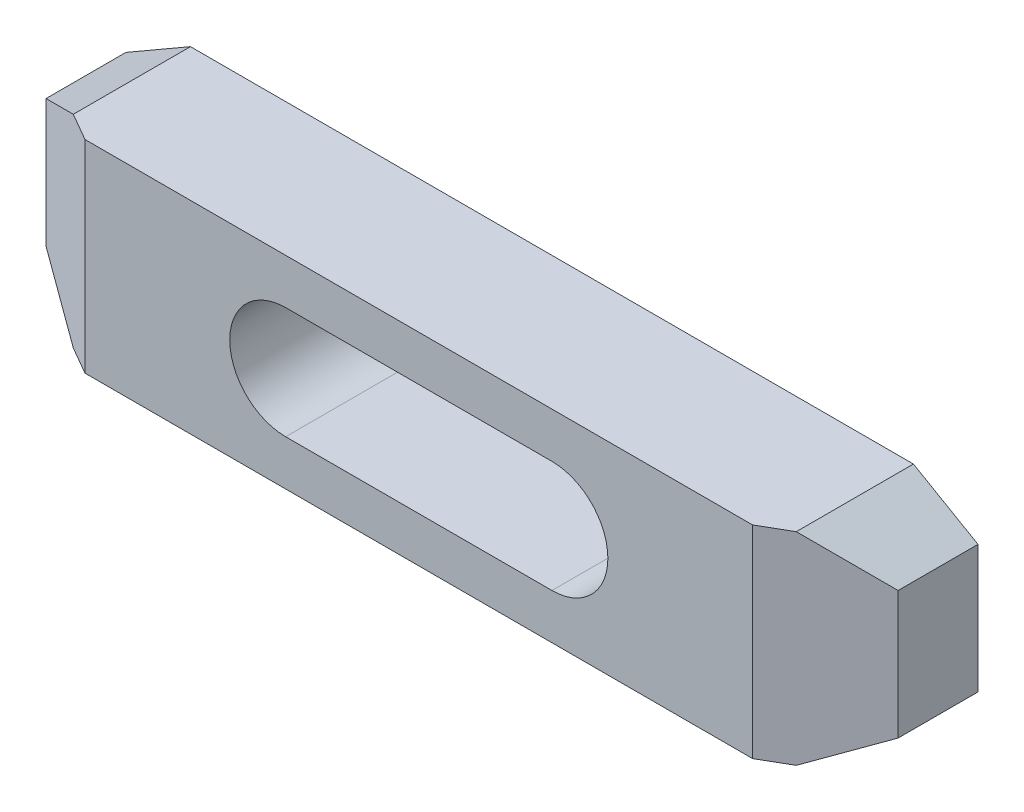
ISO-10303-21;
HEADER;
FILE_DESCRIPTION(('STEP AP214'),'2;1');
FILE_NAME('part.step','',(''),(''),'','','');
FILE_SCHEMA(('AUTOMOTIVE_DESIGN { 1 0 10303 214 1 1 1 1 }'));
ENDSEC;
DATA;
#1=APPLICATION_CONTEXT('core data for automotive mechanical design processes');
#2=APPLICATION_PROTOCOL_DEFINITION('international standard','automotive_design',2000,#1);
#3=PRODUCT_CONTEXT('',#1,'mechanical');
#4=PRODUCT('Part','Part','',(#3));
#5=PRODUCT_RELATED_PRODUCT_CATEGORY('part','',(#4));
#6=PRODUCT_DEFINITION_FORMATION('','',#4);
#7=PRODUCT_DEFINITION_CONTEXT('part definition',#1,'design');
#8=PRODUCT_DEFINITION('design','',#6,#7);
#9=PRODUCT_DEFINITION_SHAPE('','',#8);
#10=(LENGTH_UNIT() NAMED_UNIT(*) SI_UNIT(.MILLI.,.METRE.));
#11=(NAMED_UNIT(*) PLANE_ANGLE_UNIT() SI_UNIT($,.RADIAN.));
#12=(NAMED_UNIT(*) SI_UNIT($,.STERADIAN.) SOLID_ANGLE_UNIT());
#13=UNCERTAINTY_MEASURE_WITH_UNIT(LENGTH_MEASURE(1.E-05),#10,'distance_accuracy_value','');
#14=(GEOMETRIC_REPRESENTATION_CONTEXT(3) GLOBAL_UNCERTAINTY_ASSIGNED_CONTEXT((#13)) GLOBAL_UNIT_ASSIGNED_CONTEXT((#10,
#11,#12)) REPRESENTATION_CONTEXT('',''));
#15=CARTESIAN_POINT('',(0.,0.,0.));
#16=DIRECTION('',(0.,0.,1.));
#17=DIRECTION('',(1.,0.,0.));
#18=AXIS2_PLACEMENT_3D('',#15,#16,#17);
#19=CARTESIAN_POINT('',(0.,-58.1880215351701,25.));
#20=DIRECTION('',(0.,0.,-1.));
#21=DIRECTION('',(-1.,0.,0.));
#22=AXIS2_PLACEMENT_3D('',#19,#20,#21);
#23=PLANE('',#22);
#24=CARTESIAN_POINT('',(25.,0.,25.));
#25=DIRECTION('',(0.,0.,1.));
#26=DIRECTION('',(1.,0.,0.));
#27=AXIS2_PLACEMENT_3D('',#24,#25,#26);
#28=CIRCLE('',#27,10.5);
#29=CARTESIAN_POINT('',(25.,-10.5,25.));
#30=VERTEX_POINT('',#29);
#31=CARTESIAN_POINT('',(25.,10.5,25.));
#32=VERTEX_POINT('',#31);
#33=EDGE_CURVE('E200',#30,#32,#28,.T.);
#34=ORIENTED_EDGE('',*,*,#33,.F.);
#35=DIRECTION('',(-1.,0.,0.));
#36=VECTOR('',#35,1.);
#37=CARTESIAN_POINT('',(25.,-10.5,25.));
#38=LINE('',#37,#36);
#39=CARTESIAN_POINT('',(-25.,-10.5,25.));
#40=VERTEX_POINT('',#39);
#41=EDGE_CURVE('E199',#30,#40,#38,.T.);
#42=ORIENTED_EDGE('',*,*,#41,.T.);
#43=CARTESIAN_POINT('',(-25.,0.,25.));
#44=DIRECTION('',(0.,0.,1.));
#45=DIRECTION('',(1.,0.,0.));
#46=AXIS2_PLACEMENT_3D('',#43,#44,#45);
#47=CIRCLE('',#46,10.5);
#48=CARTESIAN_POINT('',(-25.,10.5,25.));
#49=VERTEX_POINT('',#48);
#50=EDGE_CURVE('E207',#49,#40,#47,.T.);
#51=ORIENTED_EDGE('',*,*,#50,.F.);
#52=DIRECTION('',(-1.,0.,0.));
#53=VECTOR('',#52,1.);
#54=CARTESIAN_POINT('',(25.,10.5,25.));
#55=LINE('',#54,#53);
#56=EDGE_CURVE('E203',#32,#49,#55,.T.);
#57=ORIENTED_EDGE('',*,*,#56,.F.);
#58=EDGE_LOOP('',(#34,#42,#51,#57));
#59=FACE_BOUND('',#58,.T.);
#60=DIRECTION('',(0.,1.,0.));
#61=VECTOR('',#60,1.);
#62=CARTESIAN_POINT('',(-62.679491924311,-58.1880215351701,25.));
#63=LINE('',#62,#61);
#64=CARTESIAN_POINT('',(-62.679491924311,-19.,25.));
#65=VERTEX_POINT('',#64);
#66=CARTESIAN_POINT('',(-62.679491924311,19.,25.));
#67=VERTEX_POINT('',#66);
#68=EDGE_CURVE('E128',#65,#67,#63,.T.);
#69=ORIENTED_EDGE('',*,*,#68,.F.);
#70=DIRECTION('',(-1.,0.,0.));
#71=VECTOR('',#70,1.);
#72=CARTESIAN_POINT('',(67.8756443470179,-19.,25.));
#73=LINE('',#72,#71);
#74=CARTESIAN_POINT('',(62.6794919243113,-19.,25.));
#75=VERTEX_POINT('',#74);
#76=EDGE_CURVE('E168',#75,#65,#73,.T.);
#77=ORIENTED_EDGE('',*,*,#76,.F.);
#78=DIRECTION('',(0.,1.,0.));
#79=VECTOR('',#78,1.);
#80=CARTESIAN_POINT('',(62.6794919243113,-58.1880215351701,25.));
#81=LINE('',#80,#79);
#82=CARTESIAN_POINT('',(62.6794919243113,19.,25.));
#83=VERTEX_POINT('',#82);
#84=EDGE_CURVE('E36',#75,#83,#81,.T.);
#85=ORIENTED_EDGE('',*,*,#84,.T.);
#86=DIRECTION('',(1.,0.,0.));
#87=VECTOR('',#86,1.);
#88=CARTESIAN_POINT('',(-67.8756443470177,19.,25.));
#89=LINE('',#88,#87);
#90=EDGE_CURVE('E167',#67,#83,#89,.T.);
#91=ORIENTED_EDGE('',*,*,#90,.F.);
#92=EDGE_LOOP('',(#69,#77,#85,#91));
#93=FACE_BOUND('',#92,.T.);
#94=ADVANCED_FACE('F14',(#59,#93),#23,.F.);
#95=CARTESIAN_POINT('',(-67.8756443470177,19.,25.));
#96=DIRECTION('',(0.,1.,0.));
#97=DIRECTION('',(-1.,0.,0.));
#98=AXIS2_PLACEMENT_3D('',#95,#96,#97);
#99=PLANE('',#98);
#100=DIRECTION('',(0.,0.,-1.));
#101=VECTOR('',#100,1.);
#102=CARTESIAN_POINT('',(-67.8756443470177,19.,25.));
#103=LINE('',#102,#101);
#104=CARTESIAN_POINT('',(-67.8756443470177,19.,22.));
#105=VERTEX_POINT('',#104);
#106=CARTESIAN_POINT('',(-67.8756443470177,19.,0.));
#107=VERTEX_POINT('',#106);
#108=EDGE_CURVE('E136',#105,#107,#103,.T.);
#109=ORIENTED_EDGE('',*,*,#108,.F.);
#110=DIRECTION('',(0.866025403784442,0.,0.5));
#111=VECTOR('',#110,1.);
#112=CARTESIAN_POINT('',(-66.576606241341,19.,22.75));
#113=LINE('',#112,#111);
#114=EDGE_CURVE('E229',#105,#67,#113,.T.);
#115=ORIENTED_EDGE('',*,*,#114,.T.);
#116=ORIENTED_EDGE('',*,*,#90,.T.);
#117=DIRECTION('',(-0.866025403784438,0.,0.5));
#118=VECTOR('',#117,1.);
#119=CARTESIAN_POINT('',(-35.2368602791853,19.,81.5320323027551));
#120=LINE('',#119,#118);
#121=CARTESIAN_POINT('',(67.8756443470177,19.,22.));
#122=VERTEX_POINT('',#121);
#123=EDGE_CURVE('E224',#122,#83,#120,.T.);
#124=ORIENTED_EDGE('',*,*,#123,.F.);
#125=DIRECTION('',(0.,0.,-1.));
#126=VECTOR('',#125,1.);
#127=CARTESIAN_POINT('',(67.8756443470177,19.,25.));
#128=LINE('',#127,#126);
#129=CARTESIAN_POINT('',(67.8756443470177,19.,0.));
#130=VERTEX_POINT('',#129);
#131=EDGE_CURVE('E143',#122,#130,#128,.T.);
#132=ORIENTED_EDGE('',*,*,#131,.T.);
#133=DIRECTION('',(1.,0.,0.));
#134=VECTOR('',#133,1.);
#135=CARTESIAN_POINT('',(-67.8756443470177,19.,0.));
#136=LINE('',#135,#134);
#137=EDGE_CURVE('E183',#107,#130,#136,.T.);
#138=ORIENTED_EDGE('',*,*,#137,.F.);
#139=EDGE_LOOP('',(#109,#115,#116,#124,#132,#138));
#140=FACE_BOUND('',#139,.T.);
#141=ADVANCED_FACE('F237',(#140),#99,.T.);
#142=CARTESIAN_POINT('',(-80.,12.,25.));
#143=DIRECTION('',(-0.5,0.866025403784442,0.));
#144=DIRECTION('',(-0.866025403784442,-0.5,0.));
#145=AXIS2_PLACEMENT_3D('',#142,#143,#144);
#146=PLANE('',#145);
#147=DIRECTION('',(0.,0.,-1.));
#148=VECTOR('',#147,1.);
#149=CARTESIAN_POINT('',(-80.,12.,25.));
#150=LINE('',#149,#148);
#151=CARTESIAN_POINT('',(-80.,12.,15.));
#152=VERTEX_POINT('',#151);
#153=CARTESIAN_POINT('',(-80.,12.,0.));
#154=VERTEX_POINT('',#153);
#155=EDGE_CURVE('E134',#152,#154,#150,.T.);
#156=ORIENTED_EDGE('',*,*,#155,.F.);
#157=DIRECTION('',(0.774596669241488,0.447213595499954,0.447213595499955));
#158=VECTOR('',#157,1.);
#159=CARTESIAN_POINT('',(-76.5358983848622,14.,17.));
#160=LINE('',#159,#158);
#161=EDGE_CURVE('E116',#152,#105,#160,.T.);
#162=ORIENTED_EDGE('',*,*,#161,.T.);
#163=ORIENTED_EDGE('',*,*,#108,.T.);
#164=DIRECTION('',(0.866025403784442,0.5,0.));
#165=VECTOR('',#164,1.);
#166=CARTESIAN_POINT('',(-80.,12.,0.));
#167=LINE('',#166,#165);
#168=EDGE_CURVE('E180',#154,#107,#167,.T.);
#169=ORIENTED_EDGE('',*,*,#168,.F.);
#170=EDGE_LOOP('',(#156,#162,#163,#169));
#171=FACE_BOUND('',#170,.T.);
#172=ADVANCED_FACE('F253',(#171),#146,.T.);
#173=CARTESIAN_POINT('',(-80.,-12.,25.));
#174=DIRECTION('',(-1.,0.,0.));
#175=DIRECTION('',(0.,0.,1.));
#176=AXIS2_PLACEMENT_3D('',#173,#174,#175);
#177=PLANE('',#176);
#178=DIRECTION('',(0.,0.,-1.));
#179=VECTOR('',#178,1.);
#180=CARTESIAN_POINT('',(-80.,-12.,25.));
#181=LINE('',#180,#179);
#182=CARTESIAN_POINT('',(-80.,-12.,15.));
#183=VERTEX_POINT('',#182);
#184=CARTESIAN_POINT('',(-80.,-12.,0.));
#185=VERTEX_POINT('',#184);
#186=EDGE_CURVE('E125',#183,#185,#181,.T.);
#187=ORIENTED_EDGE('',*,*,#186,.F.);
#188=DIRECTION('',(0.,1.,0.));
#189=VECTOR('',#188,1.);
#190=CARTESIAN_POINT('',(-80.,-20.,15.));
#191=LINE('',#190,#189);
#192=EDGE_CURVE('E113',#183,#152,#191,.T.);
#193=ORIENTED_EDGE('',*,*,#192,.T.);
#194=ORIENTED_EDGE('',*,*,#155,.T.);
#195=DIRECTION('',(0.,1.,0.));
#196=VECTOR('',#195,1.);
#197=CARTESIAN_POINT('',(-80.,-12.,0.));
#198=LINE('',#197,#196);
#199=EDGE_CURVE('E133',#185,#154,#198,.T.);
#200=ORIENTED_EDGE('',*,*,#199,.F.);
#201=EDGE_LOOP('',(#187,#193,#194,#200));
#202=FACE_BOUND('',#201,.T.);
#203=ADVANCED_FACE('F131',(#202),#177,.T.);
#204=CARTESIAN_POINT('',(-67.8756443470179,-19.,25.));
#205=DIRECTION('',(-0.5,-0.866025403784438,0.));
#206=DIRECTION('',(0.866025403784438,-0.5,0.));
#207=AXIS2_PLACEMENT_3D('',#204,#205,#206);
#208=PLANE('',#207);
#209=DIRECTION('',(0.,0.,-1.));
#210=VECTOR('',#209,1.);
#211=CARTESIAN_POINT('',(-67.8756443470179,-19.,25.));
#212=LINE('',#211,#210);
#213=CARTESIAN_POINT('',(-67.8756443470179,-19.,22.));
#214=VERTEX_POINT('',#213);
#215=CARTESIAN_POINT('',(-67.8756443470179,-19.,0.));
#216=VERTEX_POINT('',#215);
#217=EDGE_CURVE('E127',#214,#216,#212,.T.);
#218=ORIENTED_EDGE('',*,*,#217,.F.);
#219=DIRECTION('',(-0.774596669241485,0.44721359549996,-0.447213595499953));
#220=VECTOR('',#219,1.);
#221=CARTESIAN_POINT('',(-66.8364138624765,-19.6,22.6));
#222=LINE('',#221,#220);
#223=EDGE_CURVE('E29',#214,#183,#222,.T.);
#224=ORIENTED_EDGE('',*,*,#223,.T.);
#225=ORIENTED_EDGE('',*,*,#186,.T.);
#226=DIRECTION('',(-0.866025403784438,0.5,0.));
#227=VECTOR('',#226,1.);
#228=CARTESIAN_POINT('',(-67.8756443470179,-19.,0.));
#229=LINE('',#228,#227);
#230=EDGE_CURVE('E177',#216,#185,#229,.T.);
#231=ORIENTED_EDGE('',*,*,#230,.F.);
#232=EDGE_LOOP('',(#218,#224,#225,#231));
#233=FACE_BOUND('',#232,.T.);
#234=ADVANCED_FACE('F123',(#233),#208,.T.);
#235=CARTESIAN_POINT('',(67.8756443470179,-19.,25.));
#236=DIRECTION('',(0.,-1.,0.));
#237=DIRECTION('',(1.,0.,0.));
#238=AXIS2_PLACEMENT_3D('',#235,#236,#237);
#239=PLANE('',#238);
#240=ORIENTED_EDGE('',*,*,#76,.T.);
#241=DIRECTION('',(-0.866025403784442,0.,-0.5));
#242=VECTOR('',#241,1.);
#243=CARTESIAN_POINT('',(35.2368602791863,-19.,81.5320323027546));
#244=LINE('',#243,#242);
#245=EDGE_CURVE('E9',#65,#214,#244,.T.);
#246=ORIENTED_EDGE('',*,*,#245,.T.);
#247=ORIENTED_EDGE('',*,*,#217,.T.);
#248=DIRECTION('',(-1.,0.,0.));
#249=VECTOR('',#248,1.);
#250=CARTESIAN_POINT('',(67.8756443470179,-19.,0.));
#251=LINE('',#250,#249);
#252=CARTESIAN_POINT('',(67.8756443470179,-19.,0.));
#253=VERTEX_POINT('',#252);
#254=EDGE_CURVE('E166',#253,#216,#251,.T.);
#255=ORIENTED_EDGE('',*,*,#254,.F.);
#256=DIRECTION('',(0.,0.,-1.));
#257=VECTOR('',#256,1.);
#258=CARTESIAN_POINT('',(67.8756443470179,-19.,25.));
#259=LINE('',#258,#257);
#260=CARTESIAN_POINT('',(67.8756443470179,-19.,22.));
#261=VERTEX_POINT('',#260);
#262=EDGE_CURVE('E138',#261,#253,#259,.T.);
#263=ORIENTED_EDGE('',*,*,#262,.F.);
#264=DIRECTION('',(0.866025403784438,0.,-0.5));
#265=VECTOR('',#264,1.);
#266=CARTESIAN_POINT('',(66.5766062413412,-19.,22.75));
#267=LINE('',#266,#265);
#268=EDGE_CURVE('E22',#75,#261,#267,.T.);
#269=ORIENTED_EDGE('',*,*,#268,.F.);
#270=EDGE_LOOP('',(#240,#246,#247,#255,#263,#269));
#271=FACE_BOUND('',#270,.T.);
#272=ADVANCED_FACE('F164',(#271),#239,.T.);
#273=CARTESIAN_POINT('',(0.,-58.1880215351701,0.));
#274=DIRECTION('',(0.,0.,-1.));
#275=DIRECTION('',(-1.,0.,0.));
#276=AXIS2_PLACEMENT_3D('',#273,#274,#275);
#277=PLANE('',#276);
#278=DIRECTION('',(-0.866025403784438,-0.5,0.));
#279=VECTOR('',#278,1.);
#280=CARTESIAN_POINT('',(80.,-12.,0.));
#281=LINE('',#280,#279);
#282=CARTESIAN_POINT('',(80.,-12.,0.));
#283=VERTEX_POINT('',#282);
#284=EDGE_CURVE('E173',#283,#253,#281,.T.);
#285=ORIENTED_EDGE('',*,*,#284,.T.);
#286=ORIENTED_EDGE('',*,*,#254,.T.);
#287=ORIENTED_EDGE('',*,*,#230,.T.);
#288=ORIENTED_EDGE('',*,*,#199,.T.);
#289=ORIENTED_EDGE('',*,*,#168,.T.);
#290=ORIENTED_EDGE('',*,*,#137,.T.);
#291=DIRECTION('',(0.866025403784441,-0.5,0.));
#292=VECTOR('',#291,1.);
#293=CARTESIAN_POINT('',(67.8756443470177,19.,0.));
#294=LINE('',#293,#292);
#295=CARTESIAN_POINT('',(80.,12.,0.));
#296=VERTEX_POINT('',#295);
#297=EDGE_CURVE('E186',#130,#296,#294,.T.);
#298=ORIENTED_EDGE('',*,*,#297,.T.);
#299=DIRECTION('',(0.,-1.,0.));
#300=VECTOR('',#299,1.);
#301=CARTESIAN_POINT('',(80.,12.,0.));
#302=LINE('',#301,#300);
#303=EDGE_CURVE('E171',#296,#283,#302,.T.);
#304=ORIENTED_EDGE('',*,*,#303,.T.);
#305=EDGE_LOOP('',(#285,#286,#287,#288,#289,#290,#298,#304));
#306=FACE_BOUND('',#305,.T.);
#307=DIRECTION('',(-1.,0.,0.));
#308=VECTOR('',#307,1.);
#309=CARTESIAN_POINT('',(25.,-10.5,0.));
#310=LINE('',#309,#308);
#311=CARTESIAN_POINT('',(25.,-10.5,0.));
#312=VERTEX_POINT('',#311);
#313=CARTESIAN_POINT('',(-25.,-10.5,0.));
#314=VERTEX_POINT('',#313);
#315=EDGE_CURVE('E204',#312,#314,#310,.T.);
#316=ORIENTED_EDGE('',*,*,#315,.F.);
#317=CARTESIAN_POINT('',(25.,0.,0.));
#318=DIRECTION('',(0.,0.,1.));
#319=DIRECTION('',(1.,0.,0.));
#320=AXIS2_PLACEMENT_3D('',#317,#318,#319);
#321=CIRCLE('',#320,10.5);
#322=CARTESIAN_POINT('',(25.,10.5,0.));
#323=VERTEX_POINT('',#322);
#324=EDGE_CURVE('E211',#312,#323,#321,.T.);
#325=ORIENTED_EDGE('',*,*,#324,.T.);
#326=DIRECTION('',(-1.,0.,0.));
#327=VECTOR('',#326,1.);
#328=CARTESIAN_POINT('',(25.,10.5,0.));
#329=LINE('',#328,#327);
#330=CARTESIAN_POINT('',(-25.,10.5,0.));
#331=VERTEX_POINT('',#330);
#332=EDGE_CURVE('E214',#323,#331,#329,.T.);
#333=ORIENTED_EDGE('',*,*,#332,.T.);
#334=CARTESIAN_POINT('',(-25.,0.,0.));
#335=DIRECTION('',(0.,0.,1.));
#336=DIRECTION('',(1.,0.,0.));
#337=AXIS2_PLACEMENT_3D('',#334,#335,#336);
#338=CIRCLE('',#337,10.5);
#339=EDGE_CURVE('E218',#331,#314,#338,.T.);
#340=ORIENTED_EDGE('',*,*,#339,.T.);
#341=EDGE_LOOP('',(#316,#325,#333,#340));
#342=FACE_BOUND('',#341,.T.);
#343=ADVANCED_FACE('F241',(#306,#342),#277,.T.);
#344=CARTESIAN_POINT('',(80.,-12.,25.));
#345=DIRECTION('',(0.5,-0.866025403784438,0.));
#346=DIRECTION('',(0.866025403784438,0.5,0.));
#347=AXIS2_PLACEMENT_3D('',#344,#345,#346);
#348=PLANE('',#347);
#349=DIRECTION('',(0.774596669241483,0.447213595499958,-0.447213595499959));
#350=VECTOR('',#349,1.);
#351=CARTESIAN_POINT('',(76.5358983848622,-14.,17.));
#352=LINE('',#351,#350);
#353=CARTESIAN_POINT('',(80.,-12.,15.));
#354=VERTEX_POINT('',#353);
#355=EDGE_CURVE('E150',#261,#354,#352,.T.);
#356=ORIENTED_EDGE('',*,*,#355,.F.);
#357=ORIENTED_EDGE('',*,*,#262,.T.);
#358=ORIENTED_EDGE('',*,*,#284,.F.);
#359=DIRECTION('',(0.,0.,-1.));
#360=VECTOR('',#359,1.);
#361=CARTESIAN_POINT('',(80.,-12.,25.));
#362=LINE('',#361,#360);
#363=EDGE_CURVE('E147',#354,#283,#362,.T.);
#364=ORIENTED_EDGE('',*,*,#363,.F.);
#365=EDGE_LOOP('',(#356,#357,#358,#364));
#366=FACE_BOUND('',#365,.T.);
#367=ADVANCED_FACE('F158',(#366),#348,.T.);
#368=CARTESIAN_POINT('',(80.,12.,25.));
#369=DIRECTION('',(1.,0.,0.));
#370=DIRECTION('',(0.,0.,-1.));
#371=AXIS2_PLACEMENT_3D('',#368,#369,#370);
#372=PLANE('',#371);
#373=DIRECTION('',(0.,1.,0.));
#374=VECTOR('',#373,1.);
#375=CARTESIAN_POINT('',(80.,-20.,15.));
#376=LINE('',#375,#374);
#377=CARTESIAN_POINT('',(80.,12.,15.));
#378=VERTEX_POINT('',#377);
#379=EDGE_CURVE('E161',#354,#378,#376,.T.);
#380=ORIENTED_EDGE('',*,*,#379,.F.);
#381=ORIENTED_EDGE('',*,*,#363,.T.);
#382=ORIENTED_EDGE('',*,*,#303,.F.);
#383=DIRECTION('',(0.,0.,-1.));
#384=VECTOR('',#383,1.);
#385=CARTESIAN_POINT('',(80.,12.,25.));
#386=LINE('',#385,#384);
#387=EDGE_CURVE('E145',#378,#296,#386,.T.);
#388=ORIENTED_EDGE('',*,*,#387,.F.);
#389=EDGE_LOOP('',(#380,#381,#382,#388));
#390=FACE_BOUND('',#389,.T.);
#391=ADVANCED_FACE('F16',(#390),#372,.T.);
#392=CARTESIAN_POINT('',(67.8756443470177,19.,25.));
#393=DIRECTION('',(0.5,0.866025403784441,0.));
#394=DIRECTION('',(-0.866025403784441,0.5,0.));
#395=AXIS2_PLACEMENT_3D('',#392,#393,#394);
#396=PLANE('',#395);
#397=DIRECTION('',(-0.774596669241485,0.447213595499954,0.44721359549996));
#398=VECTOR('',#397,1.);
#399=CARTESIAN_POINT('',(66.8364138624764,19.6,22.6));
#400=LINE('',#399,#398);
#401=EDGE_CURVE('E215',#378,#122,#400,.T.);
#402=ORIENTED_EDGE('',*,*,#401,.F.);
#403=ORIENTED_EDGE('',*,*,#387,.T.);
#404=ORIENTED_EDGE('',*,*,#297,.F.);
#405=ORIENTED_EDGE('',*,*,#131,.F.);
#406=EDGE_LOOP('',(#402,#403,#404,#405));
#407=FACE_BOUND('',#406,.T.);
#408=ADVANCED_FACE('F250',(#407),#396,.T.);
#409=CARTESIAN_POINT('',(25.,0.,25.));
#410=DIRECTION('',(0.,0.,-1.));
#411=DIRECTION('',(-1.,0.,0.));
#412=AXIS2_PLACEMENT_3D('',#409,#410,#411);
#413=CYLINDRICAL_SURFACE('',#412,10.5);
#414=DIRECTION('',(0.,0.,-1.));
#415=VECTOR('',#414,1.);
#416=CARTESIAN_POINT('',(25.,10.5,25.));
#417=LINE('',#416,#415);
#418=EDGE_CURVE('E175',#32,#323,#417,.T.);
#419=ORIENTED_EDGE('',*,*,#418,.T.);
#420=ORIENTED_EDGE('',*,*,#324,.F.);
#421=DIRECTION('',(0.,0.,-1.));
#422=VECTOR('',#421,1.);
#423=CARTESIAN_POINT('',(25.,-10.5,25.));
#424=LINE('',#423,#422);
#425=EDGE_CURVE('E196',#30,#312,#424,.T.);
#426=ORIENTED_EDGE('',*,*,#425,.F.);
#427=ORIENTED_EDGE('',*,*,#33,.T.);
#428=EDGE_LOOP('',(#419,#420,#426,#427));
#429=FACE_BOUND('',#428,.T.);
#430=ADVANCED_FACE('F312',(#429),#413,.F.);
#431=CARTESIAN_POINT('',(25.,10.5,25.));
#432=DIRECTION('',(0.,-1.,0.));
#433=DIRECTION('',(1.,0.,0.));
#434=AXIS2_PLACEMENT_3D('',#431,#432,#433);
#435=PLANE('',#434);
#436=DIRECTION('',(0.,0.,-1.));
#437=VECTOR('',#436,1.);
#438=CARTESIAN_POINT('',(-25.,10.5,25.));
#439=LINE('',#438,#437);
#440=EDGE_CURVE('E192',#49,#331,#439,.T.);
#441=ORIENTED_EDGE('',*,*,#440,.T.);
#442=ORIENTED_EDGE('',*,*,#332,.F.);
#443=ORIENTED_EDGE('',*,*,#418,.F.);
#444=ORIENTED_EDGE('',*,*,#56,.T.);
#445=EDGE_LOOP('',(#441,#442,#443,#444));
#446=FACE_BOUND('',#445,.T.);
#447=ADVANCED_FACE('F319',(#446),#435,.T.);
#448=CARTESIAN_POINT('',(-25.,0.,25.));
#449=DIRECTION('',(0.,0.,-1.));
#450=DIRECTION('',(-1.,0.,0.));
#451=AXIS2_PLACEMENT_3D('',#448,#449,#450);
#452=CYLINDRICAL_SURFACE('',#451,10.5);
#453=DIRECTION('',(0.,0.,-1.));
#454=VECTOR('',#453,1.);
#455=CARTESIAN_POINT('',(-25.,-10.5,25.));
#456=LINE('',#455,#454);
#457=EDGE_CURVE('E194',#40,#314,#456,.T.);
#458=ORIENTED_EDGE('',*,*,#457,.T.);
#459=ORIENTED_EDGE('',*,*,#339,.F.);
#460=ORIENTED_EDGE('',*,*,#440,.F.);
#461=ORIENTED_EDGE('',*,*,#50,.T.);
#462=EDGE_LOOP('',(#458,#459,#460,#461));
#463=FACE_BOUND('',#462,.T.);
#464=ADVANCED_FACE('F328',(#463),#452,.F.);
#465=CARTESIAN_POINT('',(25.,-10.5,25.));
#466=DIRECTION('',(0.,-1.,0.));
#467=DIRECTION('',(1.,0.,0.));
#468=AXIS2_PLACEMENT_3D('',#465,#466,#467);
#469=PLANE('',#468);
#470=ORIENTED_EDGE('',*,*,#41,.F.);
#471=ORIENTED_EDGE('',*,*,#425,.T.);
#472=ORIENTED_EDGE('',*,*,#315,.T.);
#473=ORIENTED_EDGE('',*,*,#457,.F.);
#474=EDGE_LOOP('',(#470,#471,#472,#473));
#475=FACE_BOUND('',#474,.T.);
#476=ADVANCED_FACE('F336',(#475),#469,.F.);
#477=CARTESIAN_POINT('',(80.,-20.,15.));
#478=DIRECTION('',(-0.5,0.,-0.866025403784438));
#479=DIRECTION('',(-0.866025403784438,0.,0.5));
#480=AXIS2_PLACEMENT_3D('',#477,#478,#479);
#481=PLANE('',#480);
#482=ORIENTED_EDGE('',*,*,#401,.T.);
#483=ORIENTED_EDGE('',*,*,#123,.T.);
#484=ORIENTED_EDGE('',*,*,#84,.F.);
#485=ORIENTED_EDGE('',*,*,#268,.T.);
#486=ORIENTED_EDGE('',*,*,#355,.T.);
#487=ORIENTED_EDGE('',*,*,#379,.T.);
#488=EDGE_LOOP('',(#482,#483,#484,#485,#486,#487));
#489=FACE_BOUND('',#488,.T.);
#490=ADVANCED_FACE('F149',(#489),#481,.F.);
#491=CARTESIAN_POINT('',(-80.,-20.,15.));
#492=DIRECTION('',(-0.5,0.,0.866025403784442));
#493=DIRECTION('',(0.866025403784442,0.,0.5));
#494=AXIS2_PLACEMENT_3D('',#491,#492,#493);
#495=PLANE('',#494);
#496=ORIENTED_EDGE('',*,*,#192,.F.);
#497=ORIENTED_EDGE('',*,*,#223,.F.);
#498=ORIENTED_EDGE('',*,*,#245,.F.);
#499=ORIENTED_EDGE('',*,*,#68,.T.);
#500=ORIENTED_EDGE('',*,*,#114,.F.);
#501=ORIENTED_EDGE('',*,*,#161,.F.);
#502=EDGE_LOOP('',(#496,#497,#498,#499,#500,#501));
#503=FACE_BOUND('',#502,.T.);
#504=ADVANCED_FACE('F114',(#503),#495,.T.);
#505=CLOSED_SHELL('',(#94,#141,#172,#203,#234,#272,#343,#367,#391,#408,#430,#447,#464,#476,#490,#504));
#506=MANIFOLD_SOLID_BREP('B1',#505);
#507=ADVANCED_BREP_SHAPE_REPRESENTATION('',(#18,#506),#14);
#508=SHAPE_DEFINITION_REPRESENTATION(#9,#507);
ENDSEC;
END-ISO-10303-21;
